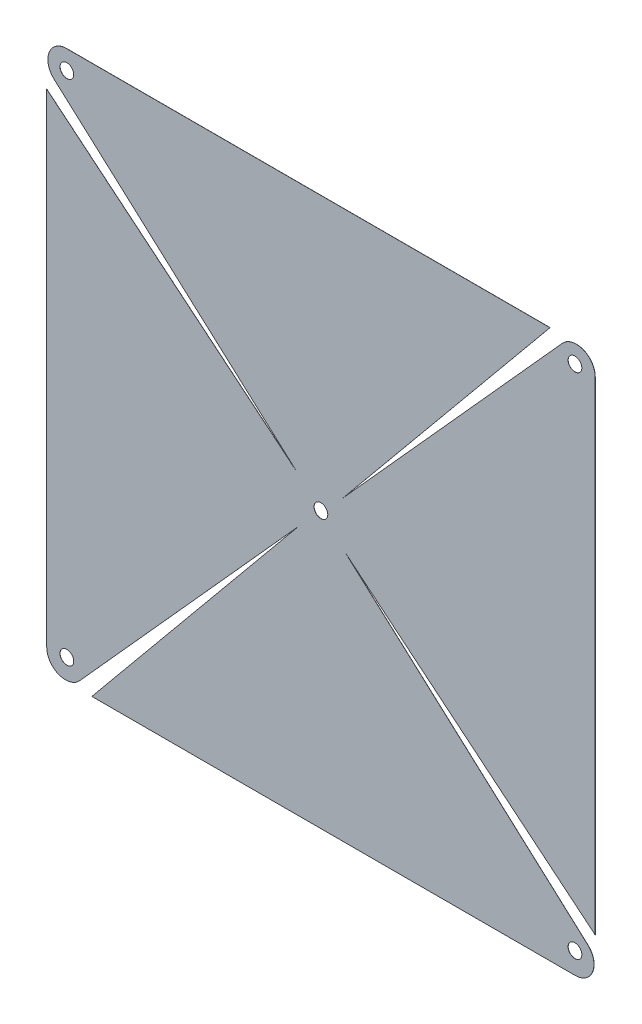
ISO-10303-21;
HEADER;
FILE_DESCRIPTION(('STEP AP214'),'2;1');
FILE_NAME('part.step','',(''),(''),'','','');
FILE_SCHEMA(('AUTOMOTIVE_DESIGN { 1 0 10303 214 1 1 1 1 }'));
ENDSEC;
DATA;
#1=APPLICATION_CONTEXT('core data for automotive mechanical design processes');
#2=APPLICATION_PROTOCOL_DEFINITION('international standard','automotive_design',2000,#1);
#3=PRODUCT_CONTEXT('',#1,'mechanical');
#4=PRODUCT('Part','Part','',(#3));
#5=PRODUCT_RELATED_PRODUCT_CATEGORY('part','',(#4));
#6=PRODUCT_DEFINITION_FORMATION('','',#4);
#7=PRODUCT_DEFINITION_CONTEXT('part definition',#1,'design');
#8=PRODUCT_DEFINITION('design','',#6,#7);
#9=PRODUCT_DEFINITION_SHAPE('','',#8);
#10=(LENGTH_UNIT() NAMED_UNIT(*) SI_UNIT(.MILLI.,.METRE.));
#11=(NAMED_UNIT(*) PLANE_ANGLE_UNIT() SI_UNIT($,.RADIAN.));
#12=(NAMED_UNIT(*) SI_UNIT($,.STERADIAN.) SOLID_ANGLE_UNIT());
#13=UNCERTAINTY_MEASURE_WITH_UNIT(LENGTH_MEASURE(1.E-05),#10,'distance_accuracy_value','');
#14=(GEOMETRIC_REPRESENTATION_CONTEXT(3) GLOBAL_UNCERTAINTY_ASSIGNED_CONTEXT((#13)) GLOBAL_UNIT_ASSIGNED_CONTEXT((#10,
#11,#12)) REPRESENTATION_CONTEXT('',''));
#15=CARTESIAN_POINT('',(0.,0.,0.));
#16=DIRECTION('',(0.,0.,1.));
#17=DIRECTION('',(1.,0.,0.));
#18=AXIS2_PLACEMENT_3D('',#15,#16,#17);
#19=CARTESIAN_POINT('',(0.,0.,0.0254));
#20=DIRECTION('',(0.,0.,1.));
#21=DIRECTION('',(1.,0.,0.));
#22=AXIS2_PLACEMENT_3D('',#19,#20,#21);
#23=PLANE('',#22);
#24=CARTESIAN_POINT('',(-51.3920991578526,-51.3920991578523,0.0254));
#25=DIRECTION('',(0.,0.,1.));
#26=DIRECTION('',(1.,0.,0.));
#27=AXIS2_PLACEMENT_3D('',#24,#25,#26);
#28=CIRCLE('',#27,1.3890625);
#29=CARTESIAN_POINT('',(-50.0030366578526,-51.3920991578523,0.0254));
#30=VERTEX_POINT('',#29);
#31=EDGE_CURVE('E432',#30,#30,#28,.T.);
#32=ORIENTED_EDGE('',*,*,#31,.F.);
#33=EDGE_LOOP('',(#32));
#34=FACE_BOUND('',#33,.T.);
#35=CARTESIAN_POINT('',(51.3920991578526,51.3920991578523,0.0254));
#36=DIRECTION('',(0.,0.,1.));
#37=DIRECTION('',(1.,0.,0.));
#38=AXIS2_PLACEMENT_3D('',#35,#36,#37);
#39=CIRCLE('',#38,1.3890625);
#40=CARTESIAN_POINT('',(52.7811616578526,51.3920991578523,0.0254));
#41=VERTEX_POINT('',#40);
#42=EDGE_CURVE('E398',#41,#41,#39,.T.);
#43=ORIENTED_EDGE('',*,*,#42,.F.);
#44=EDGE_LOOP('',(#43));
#45=FACE_BOUND('',#44,.T.);
#46=DIRECTION('',(-1.,0.,0.));
#47=VECTOR('',#46,1.);
#48=CARTESIAN_POINT('',(-61.346605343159,55.2367315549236,0.0254));
#49=LINE('',#48,#47);
#50=CARTESIAN_POINT('',(46.349121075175,55.2367315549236,0.0254));
#51=VERTEX_POINT('',#50);
#52=CARTESIAN_POINT('',(-51.4212160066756,55.2367315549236,0.0254));
#53=VERTEX_POINT('',#52);
#54=EDGE_CURVE('E287',#51,#53,#49,.T.);
#55=ORIENTED_EDGE('',*,*,#54,.T.);
#56=CARTESIAN_POINT('',(-51.4212160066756,51.4267315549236,0.0254));
#57=DIRECTION('',(0.,0.,1.));
#58=DIRECTION('',(1.,0.,0.));
#59=AXIS2_PLACEMENT_3D('',#56,#57,#58);
#60=CIRCLE('',#59,3.81);
#61=CARTESIAN_POINT('',(-53.9706036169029,48.5953497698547,0.0254));
#62=VERTEX_POINT('',#61);
#63=EDGE_CURVE('E196',#53,#62,#60,.T.);
#64=ORIENTED_EDGE('',*,*,#63,.T.);
#65=DIRECTION('',(0.743144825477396,-0.669130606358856,0.));
#66=VECTOR('',#65,1.);
#67=CARTESIAN_POINT('',(-4.71896964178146,4.24897935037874,0.0254));
#68=LINE('',#67,#66);
#69=CARTESIAN_POINT('',(-4.71896964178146,4.24897935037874,0.0254));
#70=VERTEX_POINT('',#69);
#71=EDGE_CURVE('E162',#62,#70,#68,.T.);
#72=ORIENTED_EDGE('',*,*,#71,.T.);
#73=DIRECTION('',(-0.771425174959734,0.636320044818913,0.));
#74=VECTOR('',#73,1.);
#75=CARTESIAN_POINT('',(-4.71896964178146,4.24897935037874,0.0254));
#76=LINE('',#75,#74);
#77=CARTESIAN_POINT('',(-55.4655731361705,46.1079723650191,0.0254));
#78=VERTEX_POINT('',#77);
#79=EDGE_CURVE('E156',#70,#78,#76,.T.);
#80=ORIENTED_EDGE('',*,*,#79,.T.);
#81=DIRECTION('',(0.,-1.,0.));
#82=VECTOR('',#81,1.);
#83=CARTESIAN_POINT('',(-55.4655731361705,-61.5877540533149,0.0254));
#84=LINE('',#83,#82);
#85=CARTESIAN_POINT('',(-55.4655731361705,-51.6623647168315,0.0254));
#86=VERTEX_POINT('',#85);
#87=EDGE_CURVE('E145',#78,#86,#84,.T.);
#88=ORIENTED_EDGE('',*,*,#87,.T.);
#89=CARTESIAN_POINT('',(-51.6555731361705,-51.6623647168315,0.0254));
#90=DIRECTION('',(0.,0.,1.));
#91=DIRECTION('',(1.,0.,0.));
#92=AXIS2_PLACEMENT_3D('',#89,#90,#91);
#93=CIRCLE('',#92,3.81);
#94=CARTESIAN_POINT('',(-48.8241913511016,-54.2117523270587,0.0254));
#95=VERTEX_POINT('',#94);
#96=EDGE_CURVE('E194',#86,#95,#93,.T.);
#97=ORIENTED_EDGE('',*,*,#96,.T.);
#98=DIRECTION('',(0.669130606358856,0.743144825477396,0.));
#99=VECTOR('',#98,1.);
#100=CARTESIAN_POINT('',(-4.47782093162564,-4.96011835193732,0.0254));
#101=LINE('',#100,#99);
#102=CARTESIAN_POINT('',(-4.47782093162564,-4.96011835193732,0.0254));
#103=VERTEX_POINT('',#102);
#104=EDGE_CURVE('E155',#95,#103,#101,.T.);
#105=ORIENTED_EDGE('',*,*,#104,.T.);
#106=DIRECTION('',(-0.636320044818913,-0.771425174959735,0.));
#107=VECTOR('',#106,1.);
#108=CARTESIAN_POINT('',(-4.47782093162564,-4.96011835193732,0.0254));
#109=LINE('',#108,#107);
#110=CARTESIAN_POINT('',(-46.336813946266,-55.7067218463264,0.0254));
#111=VERTEX_POINT('',#110);
#112=EDGE_CURVE('E299',#103,#111,#109,.T.);
#113=ORIENTED_EDGE('',*,*,#112,.T.);
#114=DIRECTION('',(1.,0.,0.));
#115=VECTOR('',#114,1.);
#116=CARTESIAN_POINT('',(61.358912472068,-55.7067218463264,0.0254));
#117=LINE('',#116,#115);
#118=CARTESIAN_POINT('',(51.4335231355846,-55.7067218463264,0.0254));
#119=VERTEX_POINT('',#118);
#120=EDGE_CURVE('E257',#111,#119,#117,.T.);
#121=ORIENTED_EDGE('',*,*,#120,.T.);
#122=CARTESIAN_POINT('',(51.4335231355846,-51.8967218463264,0.0254));
#123=DIRECTION('',(0.,0.,1.));
#124=DIRECTION('',(1.,0.,0.));
#125=AXIS2_PLACEMENT_3D('',#122,#123,#124);
#126=CIRCLE('',#125,3.81);
#127=CARTESIAN_POINT('',(53.9829107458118,-49.0653400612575,0.0254));
#128=VERTEX_POINT('',#127);
#129=EDGE_CURVE('E192',#119,#128,#126,.T.);
#130=ORIENTED_EDGE('',*,*,#129,.T.);
#131=DIRECTION('',(-0.743144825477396,0.669130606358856,0.));
#132=VECTOR('',#131,1.);
#133=CARTESIAN_POINT('',(4.73127677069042,-4.7189696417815,0.0254));
#134=LINE('',#133,#132);
#135=CARTESIAN_POINT('',(4.73127677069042,-4.7189696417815,0.0254));
#136=VERTEX_POINT('',#135);
#137=EDGE_CURVE('E282',#128,#136,#134,.T.);
#138=ORIENTED_EDGE('',*,*,#137,.T.);
#139=DIRECTION('',(0.771425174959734,-0.636320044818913,0.));
#140=VECTOR('',#139,1.);
#141=CARTESIAN_POINT('',(4.73127677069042,-4.7189696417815,0.0254));
#142=LINE('',#141,#140);
#143=CARTESIAN_POINT('',(55.4778802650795,-46.5779626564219,0.0254));
#144=VERTEX_POINT('',#143);
#145=EDGE_CURVE('E278',#136,#144,#142,.T.);
#146=ORIENTED_EDGE('',*,*,#145,.T.);
#147=DIRECTION('',(0.,1.,0.));
#148=VECTOR('',#147,1.);
#149=CARTESIAN_POINT('',(55.4778802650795,61.1177637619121,0.0254));
#150=LINE('',#149,#148);
#151=CARTESIAN_POINT('',(55.4778802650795,51.1923744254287,0.0254));
#152=VERTEX_POINT('',#151);
#153=EDGE_CURVE('E277',#144,#152,#150,.T.);
#154=ORIENTED_EDGE('',*,*,#153,.T.);
#155=CARTESIAN_POINT('',(51.6678802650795,51.1923744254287,0.0254));
#156=DIRECTION('',(0.,0.,1.));
#157=DIRECTION('',(1.,0.,0.));
#158=AXIS2_PLACEMENT_3D('',#155,#156,#157);
#159=CIRCLE('',#158,3.81);
#160=CARTESIAN_POINT('',(48.8364984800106,53.741762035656,0.0254));
#161=VERTEX_POINT('',#160);
#162=EDGE_CURVE('E47',#152,#161,#159,.T.);
#163=ORIENTED_EDGE('',*,*,#162,.T.);
#164=DIRECTION('',(-0.669130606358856,-0.743144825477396,0.));
#165=VECTOR('',#164,1.);
#166=CARTESIAN_POINT('',(4.49012806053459,4.49012806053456,0.0254));
#167=LINE('',#166,#165);
#168=CARTESIAN_POINT('',(4.49012806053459,4.49012806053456,0.0254));
#169=VERTEX_POINT('',#168);
#170=EDGE_CURVE('E214',#161,#169,#167,.T.);
#171=ORIENTED_EDGE('',*,*,#170,.T.);
#172=DIRECTION('',(0.636320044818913,0.771425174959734,0.));
#173=VECTOR('',#172,1.);
#174=CARTESIAN_POINT('',(4.49012806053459,4.49012806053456,0.0254));
#175=LINE('',#174,#173);
#176=EDGE_CURVE('E280',#169,#51,#175,.T.);
#177=ORIENTED_EDGE('',*,*,#176,.T.);
#178=EDGE_LOOP('',(#55,#64,#72,#80,#88,#97,#105,#113,#121,#130,#138,#146,#154,#163,#171,#177));
#179=FACE_BOUND('',#178,.T.);
#180=CARTESIAN_POINT('',(0.,0.,0.0254));
#181=DIRECTION('',(0.,0.,1.));
#182=DIRECTION('',(1.,0.,0.));
#183=AXIS2_PLACEMENT_3D('',#180,#181,#182);
#184=CIRCLE('',#183,1.3890625);
#185=CARTESIAN_POINT('',(1.3890625,0.,0.0254));
#186=VERTEX_POINT('',#185);
#187=EDGE_CURVE('E292',#186,#186,#184,.T.);
#188=ORIENTED_EDGE('',*,*,#187,.F.);
#189=EDGE_LOOP('',(#188));
#190=FACE_BOUND('',#189,.T.);
#191=CARTESIAN_POINT('',(51.3920991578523,-51.3920991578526,0.0254));
#192=DIRECTION('',(0.,0.,1.));
#193=DIRECTION('',(1.,0.,0.));
#194=AXIS2_PLACEMENT_3D('',#191,#192,#193);
#195=CIRCLE('',#194,1.38906249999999);
#196=CARTESIAN_POINT('',(52.7811616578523,-51.3920991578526,0.0254));
#197=VERTEX_POINT('',#196);
#198=EDGE_CURVE('E403',#197,#197,#195,.T.);
#199=ORIENTED_EDGE('',*,*,#198,.F.);
#200=EDGE_LOOP('',(#199));
#201=FACE_BOUND('',#200,.T.);
#202=CARTESIAN_POINT('',(-51.3920991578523,51.3920991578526,0.0254));
#203=DIRECTION('',(0.,0.,1.));
#204=DIRECTION('',(1.,0.,0.));
#205=AXIS2_PLACEMENT_3D('',#202,#203,#204);
#206=CIRCLE('',#205,1.38906249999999);
#207=CARTESIAN_POINT('',(-50.0030366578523,51.3920991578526,0.0254));
#208=VERTEX_POINT('',#207);
#209=EDGE_CURVE('E428',#208,#208,#206,.T.);
#210=ORIENTED_EDGE('',*,*,#209,.F.);
#211=EDGE_LOOP('',(#210));
#212=FACE_BOUND('',#211,.T.);
#213=ADVANCED_FACE('F32',(#34,#45,#179,#190,#201,#212),#23,.T.);
#214=CARTESIAN_POINT('',(0.,0.,0.));
#215=DIRECTION('',(0.,0.,1.));
#216=DIRECTION('',(1.,0.,0.));
#217=AXIS2_PLACEMENT_3D('',#214,#215,#216);
#218=PLANE('',#217);
#219=DIRECTION('',(0.743144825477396,-0.669130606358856,0.));
#220=VECTOR('',#219,1.);
#221=CARTESIAN_POINT('',(-4.71896964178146,4.24897935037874,0.));
#222=LINE('',#221,#220);
#223=CARTESIAN_POINT('',(-53.9706036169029,48.5953497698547,0.));
#224=VERTEX_POINT('',#223);
#225=CARTESIAN_POINT('',(-4.71896964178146,4.24897935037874,0.));
#226=VERTEX_POINT('',#225);
#227=EDGE_CURVE('E166',#224,#226,#222,.T.);
#228=ORIENTED_EDGE('',*,*,#227,.F.);
#229=CARTESIAN_POINT('',(-51.4212160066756,51.4267315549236,0.));
#230=DIRECTION('',(0.,0.,1.));
#231=DIRECTION('',(1.,0.,0.));
#232=AXIS2_PLACEMENT_3D('',#229,#230,#231);
#233=CIRCLE('',#232,3.81);
#234=CARTESIAN_POINT('',(-51.4212160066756,55.2367315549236,0.));
#235=VERTEX_POINT('',#234);
#236=EDGE_CURVE('E187',#224,#235,#233,.F.);
#237=ORIENTED_EDGE('',*,*,#236,.T.);
#238=DIRECTION('',(-1.,0.,0.));
#239=VECTOR('',#238,1.);
#240=CARTESIAN_POINT('',(-61.346605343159,55.2367315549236,0.));
#241=LINE('',#240,#239);
#242=CARTESIAN_POINT('',(46.349121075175,55.2367315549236,0.));
#243=VERTEX_POINT('',#242);
#244=EDGE_CURVE('E226',#243,#235,#241,.T.);
#245=ORIENTED_EDGE('',*,*,#244,.F.);
#246=DIRECTION('',(0.636320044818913,0.771425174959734,0.));
#247=VECTOR('',#246,1.);
#248=CARTESIAN_POINT('',(4.49012806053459,4.49012806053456,0.));
#249=LINE('',#248,#247);
#250=CARTESIAN_POINT('',(4.49012806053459,4.49012806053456,0.));
#251=VERTEX_POINT('',#250);
#252=EDGE_CURVE('E223',#251,#243,#249,.T.);
#253=ORIENTED_EDGE('',*,*,#252,.F.);
#254=DIRECTION('',(-0.669130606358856,-0.743144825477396,0.));
#255=VECTOR('',#254,1.);
#256=CARTESIAN_POINT('',(4.49012806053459,4.49012806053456,0.));
#257=LINE('',#256,#255);
#258=CARTESIAN_POINT('',(48.8364984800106,53.741762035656,0.));
#259=VERTEX_POINT('',#258);
#260=EDGE_CURVE('E212',#259,#251,#257,.T.);
#261=ORIENTED_EDGE('',*,*,#260,.F.);
#262=CARTESIAN_POINT('',(51.6678802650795,51.1923744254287,0.));
#263=DIRECTION('',(0.,0.,1.));
#264=DIRECTION('',(1.,0.,0.));
#265=AXIS2_PLACEMENT_3D('',#262,#263,#264);
#266=CIRCLE('',#265,3.81);
#267=CARTESIAN_POINT('',(55.4778802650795,51.1923744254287,0.));
#268=VERTEX_POINT('',#267);
#269=EDGE_CURVE('E175',#259,#268,#266,.F.);
#270=ORIENTED_EDGE('',*,*,#269,.T.);
#271=DIRECTION('',(0.,1.,0.));
#272=VECTOR('',#271,1.);
#273=CARTESIAN_POINT('',(55.4778802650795,61.1177637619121,0.));
#274=LINE('',#273,#272);
#275=CARTESIAN_POINT('',(55.4778802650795,-46.5779626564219,0.));
#276=VERTEX_POINT('',#275);
#277=EDGE_CURVE('E224',#276,#268,#274,.T.);
#278=ORIENTED_EDGE('',*,*,#277,.F.);
#279=DIRECTION('',(0.771425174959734,-0.636320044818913,0.));
#280=VECTOR('',#279,1.);
#281=CARTESIAN_POINT('',(4.73127677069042,-4.7189696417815,0.));
#282=LINE('',#281,#280);
#283=CARTESIAN_POINT('',(4.73127677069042,-4.7189696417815,0.));
#284=VERTEX_POINT('',#283);
#285=EDGE_CURVE('E228',#284,#276,#282,.T.);
#286=ORIENTED_EDGE('',*,*,#285,.F.);
#287=DIRECTION('',(-0.743144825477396,0.669130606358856,0.));
#288=VECTOR('',#287,1.);
#289=CARTESIAN_POINT('',(4.73127677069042,-4.7189696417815,0.));
#290=LINE('',#289,#288);
#291=CARTESIAN_POINT('',(53.9829107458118,-49.0653400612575,0.));
#292=VERTEX_POINT('',#291);
#293=EDGE_CURVE('E264',#292,#284,#290,.T.);
#294=ORIENTED_EDGE('',*,*,#293,.F.);
#295=CARTESIAN_POINT('',(51.4335231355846,-51.8967218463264,0.));
#296=DIRECTION('',(0.,0.,1.));
#297=DIRECTION('',(1.,0.,0.));
#298=AXIS2_PLACEMENT_3D('',#295,#296,#297);
#299=CIRCLE('',#298,3.81);
#300=CARTESIAN_POINT('',(51.4335231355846,-55.7067218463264,0.));
#301=VERTEX_POINT('',#300);
#302=EDGE_CURVE('E183',#292,#301,#299,.F.);
#303=ORIENTED_EDGE('',*,*,#302,.T.);
#304=DIRECTION('',(1.,0.,0.));
#305=VECTOR('',#304,1.);
#306=CARTESIAN_POINT('',(61.358912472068,-55.7067218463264,0.));
#307=LINE('',#306,#305);
#308=CARTESIAN_POINT('',(-46.336813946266,-55.7067218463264,0.));
#309=VERTEX_POINT('',#308);
#310=EDGE_CURVE('E254',#309,#301,#307,.T.);
#311=ORIENTED_EDGE('',*,*,#310,.F.);
#312=DIRECTION('',(-0.636320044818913,-0.771425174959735,0.));
#313=VECTOR('',#312,1.);
#314=CARTESIAN_POINT('',(-4.47782093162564,-4.96011835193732,0.));
#315=LINE('',#314,#313);
#316=CARTESIAN_POINT('',(-4.47782093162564,-4.96011835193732,0.));
#317=VERTEX_POINT('',#316);
#318=EDGE_CURVE('E262',#317,#309,#315,.T.);
#319=ORIENTED_EDGE('',*,*,#318,.F.);
#320=DIRECTION('',(0.669130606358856,0.743144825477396,0.));
#321=VECTOR('',#320,1.);
#322=CARTESIAN_POINT('',(-4.47782093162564,-4.96011835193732,0.));
#323=LINE('',#322,#321);
#324=CARTESIAN_POINT('',(-48.8241913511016,-54.2117523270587,0.));
#325=VERTEX_POINT('',#324);
#326=EDGE_CURVE('E267',#325,#317,#323,.T.);
#327=ORIENTED_EDGE('',*,*,#326,.F.);
#328=CARTESIAN_POINT('',(-51.6555731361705,-51.6623647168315,0.));
#329=DIRECTION('',(0.,0.,1.));
#330=DIRECTION('',(1.,0.,0.));
#331=AXIS2_PLACEMENT_3D('',#328,#329,#330);
#332=CIRCLE('',#331,3.81);
#333=CARTESIAN_POINT('',(-55.4655731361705,-51.6623647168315,0.));
#334=VERTEX_POINT('',#333);
#335=EDGE_CURVE('E185',#325,#334,#332,.F.);
#336=ORIENTED_EDGE('',*,*,#335,.T.);
#337=DIRECTION('',(0.,-1.,0.));
#338=VECTOR('',#337,1.);
#339=CARTESIAN_POINT('',(-55.4655731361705,-61.5877540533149,0.));
#340=LINE('',#339,#338);
#341=CARTESIAN_POINT('',(-55.4655731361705,46.1079723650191,0.));
#342=VERTEX_POINT('',#341);
#343=EDGE_CURVE('E291',#342,#334,#340,.T.);
#344=ORIENTED_EDGE('',*,*,#343,.F.);
#345=DIRECTION('',(-0.771425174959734,0.636320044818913,0.));
#346=VECTOR('',#345,1.);
#347=CARTESIAN_POINT('',(-4.71896964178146,4.24897935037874,0.));
#348=LINE('',#347,#346);
#349=EDGE_CURVE('E170',#226,#342,#348,.T.);
#350=ORIENTED_EDGE('',*,*,#349,.F.);
#351=EDGE_LOOP('',(#228,#237,#245,#253,#261,#270,#278,#286,#294,#303,#311,#319,#327,#336,#344,#350));
#352=FACE_BOUND('',#351,.T.);
#353=CARTESIAN_POINT('',(0.,0.,0.));
#354=DIRECTION('',(0.,0.,1.));
#355=DIRECTION('',(1.,0.,0.));
#356=AXIS2_PLACEMENT_3D('',#353,#354,#355);
#357=CIRCLE('',#356,1.3890625);
#358=CARTESIAN_POINT('',(1.3890625,0.,0.));
#359=VERTEX_POINT('',#358);
#360=EDGE_CURVE('E405',#359,#359,#357,.T.);
#361=ORIENTED_EDGE('',*,*,#360,.T.);
#362=EDGE_LOOP('',(#361));
#363=FACE_BOUND('',#362,.T.);
#364=CARTESIAN_POINT('',(51.3920991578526,51.3920991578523,0.));
#365=DIRECTION('',(0.,0.,1.));
#366=DIRECTION('',(1.,0.,0.));
#367=AXIS2_PLACEMENT_3D('',#364,#365,#366);
#368=CIRCLE('',#367,1.3890625);
#369=CARTESIAN_POINT('',(52.7811616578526,51.3920991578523,0.));
#370=VERTEX_POINT('',#369);
#371=EDGE_CURVE('E401',#370,#370,#368,.T.);
#372=ORIENTED_EDGE('',*,*,#371,.T.);
#373=EDGE_LOOP('',(#372));
#374=FACE_BOUND('',#373,.T.);
#375=CARTESIAN_POINT('',(51.3920991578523,-51.3920991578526,0.));
#376=DIRECTION('',(0.,0.,1.));
#377=DIRECTION('',(1.,0.,0.));
#378=AXIS2_PLACEMENT_3D('',#375,#376,#377);
#379=CIRCLE('',#378,1.38906249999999);
#380=CARTESIAN_POINT('',(52.7811616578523,-51.3920991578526,0.));
#381=VERTEX_POINT('',#380);
#382=EDGE_CURVE('E408',#381,#381,#379,.T.);
#383=ORIENTED_EDGE('',*,*,#382,.T.);
#384=EDGE_LOOP('',(#383));
#385=FACE_BOUND('',#384,.T.);
#386=CARTESIAN_POINT('',(-51.3920991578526,-51.3920991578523,0.));
#387=DIRECTION('',(0.,0.,1.));
#388=DIRECTION('',(1.,0.,0.));
#389=AXIS2_PLACEMENT_3D('',#386,#387,#388);
#390=CIRCLE('',#389,1.3890625);
#391=CARTESIAN_POINT('',(-50.0030366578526,-51.3920991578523,0.));
#392=VERTEX_POINT('',#391);
#393=EDGE_CURVE('E424',#392,#392,#390,.T.);
#394=ORIENTED_EDGE('',*,*,#393,.T.);
#395=EDGE_LOOP('',(#394));
#396=FACE_BOUND('',#395,.T.);
#397=CARTESIAN_POINT('',(-51.3920991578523,51.3920991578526,0.));
#398=DIRECTION('',(0.,0.,1.));
#399=DIRECTION('',(1.,0.,0.));
#400=AXIS2_PLACEMENT_3D('',#397,#398,#399);
#401=CIRCLE('',#400,1.38906249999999);
#402=CARTESIAN_POINT('',(-50.0030366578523,51.3920991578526,0.));
#403=VERTEX_POINT('',#402);
#404=EDGE_CURVE('E427',#403,#403,#401,.T.);
#405=ORIENTED_EDGE('',*,*,#404,.T.);
#406=EDGE_LOOP('',(#405));
#407=FACE_BOUND('',#406,.T.);
#408=ADVANCED_FACE('F219',(#352,#363,#374,#385,#396,#407),#218,.F.);
#409=CARTESIAN_POINT('',(-4.71896964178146,4.24897935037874,0.0254));
#410=DIRECTION('',(-0.636320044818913,-0.771425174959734,0.));
#411=DIRECTION('',(0.771425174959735,-0.636320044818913,0.));
#412=AXIS2_PLACEMENT_3D('',#409,#410,#411);
#413=PLANE('',#412);
#414=ORIENTED_EDGE('',*,*,#349,.T.);
#415=DIRECTION('',(0.,0.,-1.));
#416=VECTOR('',#415,1.);
#417=CARTESIAN_POINT('',(-55.4655731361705,46.1079723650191,0.0254));
#418=LINE('',#417,#416);
#419=EDGE_CURVE('E150',#78,#342,#418,.T.);
#420=ORIENTED_EDGE('',*,*,#419,.F.);
#421=ORIENTED_EDGE('',*,*,#79,.F.);
#422=DIRECTION('',(0.,0.,-1.));
#423=VECTOR('',#422,1.);
#424=CARTESIAN_POINT('',(-4.71896964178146,4.24897935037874,0.0254));
#425=LINE('',#424,#423);
#426=EDGE_CURVE('E235',#70,#226,#425,.T.);
#427=ORIENTED_EDGE('',*,*,#426,.T.);
#428=EDGE_LOOP('',(#414,#420,#421,#427));
#429=FACE_BOUND('',#428,.T.);
#430=ADVANCED_FACE('F168',(#429),#413,.F.);
#431=CARTESIAN_POINT('',(-55.4655731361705,-61.5877540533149,0.0254));
#432=DIRECTION('',(1.,0.,0.));
#433=DIRECTION('',(0.,1.,0.));
#434=AXIS2_PLACEMENT_3D('',#431,#432,#433);
#435=PLANE('',#434);
#436=ORIENTED_EDGE('',*,*,#343,.T.);
#437=DIRECTION('',(0.,0.,-1.));
#438=VECTOR('',#437,1.);
#439=CARTESIAN_POINT('',(-55.4655731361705,-51.6623647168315,0.0254));
#440=LINE('',#439,#438);
#441=EDGE_CURVE('E153',#334,#86,#440,.F.);
#442=ORIENTED_EDGE('',*,*,#441,.T.);
#443=ORIENTED_EDGE('',*,*,#87,.F.);
#444=ORIENTED_EDGE('',*,*,#419,.T.);
#445=EDGE_LOOP('',(#436,#442,#443,#444));
#446=FACE_BOUND('',#445,.T.);
#447=ADVANCED_FACE('F148',(#446),#435,.F.);
#448=CARTESIAN_POINT('',(-4.47782093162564,-4.96011835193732,0.0254));
#449=DIRECTION('',(-0.743144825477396,0.669130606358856,0.));
#450=DIRECTION('',(-0.669130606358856,-0.743144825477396,0.));
#451=AXIS2_PLACEMENT_3D('',#448,#449,#450);
#452=PLANE('',#451);
#453=ORIENTED_EDGE('',*,*,#104,.F.);
#454=DIRECTION('',(0.,0.,-1.));
#455=VECTOR('',#454,1.);
#456=CARTESIAN_POINT('',(-48.8241913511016,-54.2117523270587,0.0254));
#457=LINE('',#456,#455);
#458=EDGE_CURVE('E198',#95,#325,#457,.T.);
#459=ORIENTED_EDGE('',*,*,#458,.T.);
#460=ORIENTED_EDGE('',*,*,#326,.T.);
#461=DIRECTION('',(0.,0.,-1.));
#462=VECTOR('',#461,1.);
#463=CARTESIAN_POINT('',(-4.47782093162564,-4.96011835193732,0.0254));
#464=LINE('',#463,#462);
#465=EDGE_CURVE('E172',#103,#317,#464,.T.);
#466=ORIENTED_EDGE('',*,*,#465,.F.);
#467=EDGE_LOOP('',(#453,#459,#460,#466));
#468=FACE_BOUND('',#467,.T.);
#469=ADVANCED_FACE('F296',(#468),#452,.F.);
#470=CARTESIAN_POINT('',(-4.47782093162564,-4.96011835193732,0.0254));
#471=DIRECTION('',(0.771425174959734,-0.636320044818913,0.));
#472=DIRECTION('',(0.636320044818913,0.771425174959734,0.));
#473=AXIS2_PLACEMENT_3D('',#470,#471,#472);
#474=PLANE('',#473);
#475=ORIENTED_EDGE('',*,*,#318,.T.);
#476=DIRECTION('',(0.,0.,-1.));
#477=VECTOR('',#476,1.);
#478=CARTESIAN_POINT('',(-46.336813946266,-55.7067218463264,0.0254));
#479=LINE('',#478,#477);
#480=EDGE_CURVE('E178',#111,#309,#479,.T.);
#481=ORIENTED_EDGE('',*,*,#480,.F.);
#482=ORIENTED_EDGE('',*,*,#112,.F.);
#483=ORIENTED_EDGE('',*,*,#465,.T.);
#484=EDGE_LOOP('',(#475,#481,#482,#483));
#485=FACE_BOUND('',#484,.T.);
#486=ADVANCED_FACE('F298',(#485),#474,.F.);
#487=CARTESIAN_POINT('',(61.358912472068,-55.7067218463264,0.0254));
#488=DIRECTION('',(0.,1.,0.));
#489=DIRECTION('',(-1.,0.,0.));
#490=AXIS2_PLACEMENT_3D('',#487,#488,#489);
#491=PLANE('',#490);
#492=ORIENTED_EDGE('',*,*,#310,.T.);
#493=DIRECTION('',(0.,0.,-1.));
#494=VECTOR('',#493,1.);
#495=CARTESIAN_POINT('',(51.4335231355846,-55.7067218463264,0.0254));
#496=LINE('',#495,#494);
#497=EDGE_CURVE('E205',#301,#119,#496,.F.);
#498=ORIENTED_EDGE('',*,*,#497,.T.);
#499=ORIENTED_EDGE('',*,*,#120,.F.);
#500=ORIENTED_EDGE('',*,*,#480,.T.);
#501=EDGE_LOOP('',(#492,#498,#499,#500));
#502=FACE_BOUND('',#501,.T.);
#503=ADVANCED_FACE('F253',(#502),#491,.F.);
#504=CARTESIAN_POINT('',(4.73127677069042,-4.7189696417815,0.0254));
#505=DIRECTION('',(-0.669130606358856,-0.743144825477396,0.));
#506=DIRECTION('',(0.743144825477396,-0.669130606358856,0.));
#507=AXIS2_PLACEMENT_3D('',#504,#505,#506);
#508=PLANE('',#507);
#509=ORIENTED_EDGE('',*,*,#137,.F.);
#510=DIRECTION('',(0.,0.,-1.));
#511=VECTOR('',#510,1.);
#512=CARTESIAN_POINT('',(53.9829107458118,-49.0653400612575,0.0254));
#513=LINE('',#512,#511);
#514=EDGE_CURVE('E202',#128,#292,#513,.T.);
#515=ORIENTED_EDGE('',*,*,#514,.T.);
#516=ORIENTED_EDGE('',*,*,#293,.T.);
#517=DIRECTION('',(0.,0.,-1.));
#518=VECTOR('',#517,1.);
#519=CARTESIAN_POINT('',(4.73127677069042,-4.7189696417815,0.0254));
#520=LINE('',#519,#518);
#521=EDGE_CURVE('E245',#136,#284,#520,.T.);
#522=ORIENTED_EDGE('',*,*,#521,.F.);
#523=EDGE_LOOP('',(#509,#515,#516,#522));
#524=FACE_BOUND('',#523,.T.);
#525=ADVANCED_FACE('F307',(#524),#508,.F.);
#526=CARTESIAN_POINT('',(4.73127677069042,-4.7189696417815,0.0254));
#527=DIRECTION('',(0.636320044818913,0.771425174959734,0.));
#528=DIRECTION('',(-0.771425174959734,0.636320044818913,0.));
#529=AXIS2_PLACEMENT_3D('',#526,#527,#528);
#530=PLANE('',#529);
#531=ORIENTED_EDGE('',*,*,#285,.T.);
#532=DIRECTION('',(0.,0.,-1.));
#533=VECTOR('',#532,1.);
#534=CARTESIAN_POINT('',(55.4778802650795,-46.5779626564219,0.0254));
#535=LINE('',#534,#533);
#536=EDGE_CURVE('E242',#144,#276,#535,.T.);
#537=ORIENTED_EDGE('',*,*,#536,.F.);
#538=ORIENTED_EDGE('',*,*,#145,.F.);
#539=ORIENTED_EDGE('',*,*,#521,.T.);
#540=EDGE_LOOP('',(#531,#537,#538,#539));
#541=FACE_BOUND('',#540,.T.);
#542=ADVANCED_FACE('F273',(#541),#530,.F.);
#543=CARTESIAN_POINT('',(55.4778802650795,61.1177637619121,0.0254));
#544=DIRECTION('',(-1.,0.,0.));
#545=DIRECTION('',(0.,0.,1.));
#546=AXIS2_PLACEMENT_3D('',#543,#544,#545);
#547=PLANE('',#546);
#548=ORIENTED_EDGE('',*,*,#277,.T.);
#549=DIRECTION('',(0.,0.,-1.));
#550=VECTOR('',#549,1.);
#551=CARTESIAN_POINT('',(55.4778802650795,51.1923744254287,0.0254));
#552=LINE('',#551,#550);
#553=EDGE_CURVE('E11',#268,#152,#552,.F.);
#554=ORIENTED_EDGE('',*,*,#553,.T.);
#555=ORIENTED_EDGE('',*,*,#153,.F.);
#556=ORIENTED_EDGE('',*,*,#536,.T.);
#557=EDGE_LOOP('',(#548,#554,#555,#556));
#558=FACE_BOUND('',#557,.T.);
#559=ADVANCED_FACE('F276',(#558),#547,.F.);
#560=CARTESIAN_POINT('',(4.49012806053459,4.49012806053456,0.0254));
#561=DIRECTION('',(0.743144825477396,-0.669130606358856,0.));
#562=DIRECTION('',(0.669130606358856,0.743144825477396,0.));
#563=AXIS2_PLACEMENT_3D('',#560,#561,#562);
#564=PLANE('',#563);
#565=ORIENTED_EDGE('',*,*,#170,.F.);
#566=DIRECTION('',(0.,0.,-1.));
#567=VECTOR('',#566,1.);
#568=CARTESIAN_POINT('',(48.8364984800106,53.741762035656,0.0254));
#569=LINE('',#568,#567);
#570=EDGE_CURVE('E40',#161,#259,#569,.T.);
#571=ORIENTED_EDGE('',*,*,#570,.T.);
#572=ORIENTED_EDGE('',*,*,#260,.T.);
#573=DIRECTION('',(0.,0.,-1.));
#574=VECTOR('',#573,1.);
#575=CARTESIAN_POINT('',(4.49012806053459,4.49012806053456,0.0254));
#576=LINE('',#575,#574);
#577=EDGE_CURVE('E240',#169,#251,#576,.T.);
#578=ORIENTED_EDGE('',*,*,#577,.F.);
#579=EDGE_LOOP('',(#565,#571,#572,#578));
#580=FACE_BOUND('',#579,.T.);
#581=ADVANCED_FACE('F210',(#580),#564,.F.);
#582=CARTESIAN_POINT('',(4.49012806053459,4.49012806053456,0.0254));
#583=DIRECTION('',(-0.771425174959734,0.636320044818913,0.));
#584=DIRECTION('',(-0.636320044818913,-0.771425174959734,0.));
#585=AXIS2_PLACEMENT_3D('',#582,#583,#584);
#586=PLANE('',#585);
#587=ORIENTED_EDGE('',*,*,#252,.T.);
#588=DIRECTION('',(0.,0.,-1.));
#589=VECTOR('',#588,1.);
#590=CARTESIAN_POINT('',(46.349121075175,55.2367315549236,0.0254));
#591=LINE('',#590,#589);
#592=EDGE_CURVE('E237',#51,#243,#591,.T.);
#593=ORIENTED_EDGE('',*,*,#592,.F.);
#594=ORIENTED_EDGE('',*,*,#176,.F.);
#595=ORIENTED_EDGE('',*,*,#577,.T.);
#596=EDGE_LOOP('',(#587,#593,#594,#595));
#597=FACE_BOUND('',#596,.T.);
#598=ADVANCED_FACE('F339',(#597),#586,.F.);
#599=CARTESIAN_POINT('',(-61.346605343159,55.2367315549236,0.0254));
#600=DIRECTION('',(0.,-1.,0.));
#601=DIRECTION('',(0.,0.,-1.));
#602=AXIS2_PLACEMENT_3D('',#599,#600,#601);
#603=PLANE('',#602);
#604=ORIENTED_EDGE('',*,*,#244,.T.);
#605=DIRECTION('',(0.,0.,-1.));
#606=VECTOR('',#605,1.);
#607=CARTESIAN_POINT('',(-51.4212160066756,55.2367315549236,0.0254));
#608=LINE('',#607,#606);
#609=EDGE_CURVE('E189',#235,#53,#608,.F.);
#610=ORIENTED_EDGE('',*,*,#609,.T.);
#611=ORIENTED_EDGE('',*,*,#54,.F.);
#612=ORIENTED_EDGE('',*,*,#592,.T.);
#613=EDGE_LOOP('',(#604,#610,#611,#612));
#614=FACE_BOUND('',#613,.T.);
#615=ADVANCED_FACE('F335',(#614),#603,.F.);
#616=CARTESIAN_POINT('',(-4.71896964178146,4.24897935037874,0.0254));
#617=DIRECTION('',(0.669130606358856,0.743144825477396,0.));
#618=DIRECTION('',(-0.743144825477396,0.669130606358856,0.));
#619=AXIS2_PLACEMENT_3D('',#616,#617,#618);
#620=PLANE('',#619);
#621=ORIENTED_EDGE('',*,*,#71,.F.);
#622=DIRECTION('',(0.,0.,-1.));
#623=VECTOR('',#622,1.);
#624=CARTESIAN_POINT('',(-53.9706036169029,48.5953497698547,0.0254));
#625=LINE('',#624,#623);
#626=EDGE_CURVE('E171',#62,#224,#625,.T.);
#627=ORIENTED_EDGE('',*,*,#626,.T.);
#628=ORIENTED_EDGE('',*,*,#227,.T.);
#629=ORIENTED_EDGE('',*,*,#426,.F.);
#630=EDGE_LOOP('',(#621,#627,#628,#629));
#631=FACE_BOUND('',#630,.T.);
#632=ADVANCED_FACE('F332',(#631),#620,.F.);
#633=CARTESIAN_POINT('',(0.,0.,0.0254));
#634=DIRECTION('',(0.,0.,-1.));
#635=DIRECTION('',(-1.,0.,0.));
#636=AXIS2_PLACEMENT_3D('',#633,#634,#635);
#637=CYLINDRICAL_SURFACE('',#636,1.3890625);
#638=ORIENTED_EDGE('',*,*,#187,.T.);
#639=EDGE_LOOP('',(#638));
#640=FACE_BOUND('',#639,.T.);
#641=ORIENTED_EDGE('',*,*,#360,.F.);
#642=EDGE_LOOP('',(#641));
#643=FACE_BOUND('',#642,.T.);
#644=ADVANCED_FACE('F329',(#640,#643),#637,.F.);
#645=CARTESIAN_POINT('',(51.3920991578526,51.3920991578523,0.0254));
#646=DIRECTION('',(0.,0.,-1.));
#647=DIRECTION('',(-1.,0.,0.));
#648=AXIS2_PLACEMENT_3D('',#645,#646,#647);
#649=CYLINDRICAL_SURFACE('',#648,1.3890625);
#650=ORIENTED_EDGE('',*,*,#42,.T.);
#651=EDGE_LOOP('',(#650));
#652=FACE_BOUND('',#651,.T.);
#653=ORIENTED_EDGE('',*,*,#371,.F.);
#654=EDGE_LOOP('',(#653));
#655=FACE_BOUND('',#654,.T.);
#656=ADVANCED_FACE('F387',(#652,#655),#649,.F.);
#657=CARTESIAN_POINT('',(51.3920991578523,-51.3920991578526,0.0254));
#658=DIRECTION('',(0.,0.,-1.));
#659=DIRECTION('',(-1.,0.,0.));
#660=AXIS2_PLACEMENT_3D('',#657,#658,#659);
#661=CYLINDRICAL_SURFACE('',#660,1.38906249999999);
#662=ORIENTED_EDGE('',*,*,#198,.T.);
#663=EDGE_LOOP('',(#662));
#664=FACE_BOUND('',#663,.T.);
#665=ORIENTED_EDGE('',*,*,#382,.F.);
#666=EDGE_LOOP('',(#665));
#667=FACE_BOUND('',#666,.T.);
#668=ADVANCED_FACE('F380',(#664,#667),#661,.F.);
#669=CARTESIAN_POINT('',(-51.3920991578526,-51.3920991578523,0.0254));
#670=DIRECTION('',(0.,0.,-1.));
#671=DIRECTION('',(-1.,0.,0.));
#672=AXIS2_PLACEMENT_3D('',#669,#670,#671);
#673=CYLINDRICAL_SURFACE('',#672,1.3890625);
#674=ORIENTED_EDGE('',*,*,#31,.T.);
#675=EDGE_LOOP('',(#674));
#676=FACE_BOUND('',#675,.T.);
#677=ORIENTED_EDGE('',*,*,#393,.F.);
#678=EDGE_LOOP('',(#677));
#679=FACE_BOUND('',#678,.T.);
#680=ADVANCED_FACE('F368',(#676,#679),#673,.F.);
#681=CARTESIAN_POINT('',(-51.3920991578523,51.3920991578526,0.0254));
#682=DIRECTION('',(0.,0.,-1.));
#683=DIRECTION('',(-1.,0.,0.));
#684=AXIS2_PLACEMENT_3D('',#681,#682,#683);
#685=CYLINDRICAL_SURFACE('',#684,1.38906249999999);
#686=ORIENTED_EDGE('',*,*,#209,.T.);
#687=EDGE_LOOP('',(#686));
#688=FACE_BOUND('',#687,.T.);
#689=ORIENTED_EDGE('',*,*,#404,.F.);
#690=EDGE_LOOP('',(#689));
#691=FACE_BOUND('',#690,.T.);
#692=ADVANCED_FACE('F363',(#688,#691),#685,.F.);
#693=CARTESIAN_POINT('',(-51.4212160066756,51.4267315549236,0.0254));
#694=DIRECTION('',(0.,0.,-1.));
#695=DIRECTION('',(-1.,0.,0.));
#696=AXIS2_PLACEMENT_3D('',#693,#694,#695);
#697=CYLINDRICAL_SURFACE('',#696,3.81);
#698=ORIENTED_EDGE('',*,*,#63,.F.);
#699=ORIENTED_EDGE('',*,*,#609,.F.);
#700=ORIENTED_EDGE('',*,*,#236,.F.);
#701=ORIENTED_EDGE('',*,*,#626,.F.);
#702=EDGE_LOOP('',(#698,#699,#700,#701));
#703=FACE_BOUND('',#702,.T.);
#704=ADVANCED_FACE('F316',(#703),#697,.T.);
#705=CARTESIAN_POINT('',(-51.6555731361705,-51.6623647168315,0.0254));
#706=DIRECTION('',(0.,0.,-1.));
#707=DIRECTION('',(-1.,0.,0.));
#708=AXIS2_PLACEMENT_3D('',#705,#706,#707);
#709=CYLINDRICAL_SURFACE('',#708,3.81);
#710=ORIENTED_EDGE('',*,*,#96,.F.);
#711=ORIENTED_EDGE('',*,*,#441,.F.);
#712=ORIENTED_EDGE('',*,*,#335,.F.);
#713=ORIENTED_EDGE('',*,*,#458,.F.);
#714=EDGE_LOOP('',(#710,#711,#712,#713));
#715=FACE_BOUND('',#714,.T.);
#716=ADVANCED_FACE('F311',(#715),#709,.T.);
#717=CARTESIAN_POINT('',(51.4335231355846,-51.8967218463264,0.0254));
#718=DIRECTION('',(0.,0.,-1.));
#719=DIRECTION('',(-1.,0.,0.));
#720=AXIS2_PLACEMENT_3D('',#717,#718,#719);
#721=CYLINDRICAL_SURFACE('',#720,3.81);
#722=ORIENTED_EDGE('',*,*,#129,.F.);
#723=ORIENTED_EDGE('',*,*,#497,.F.);
#724=ORIENTED_EDGE('',*,*,#302,.F.);
#725=ORIENTED_EDGE('',*,*,#514,.F.);
#726=EDGE_LOOP('',(#722,#723,#724,#725));
#727=FACE_BOUND('',#726,.T.);
#728=ADVANCED_FACE('F309',(#727),#721,.T.);
#729=CARTESIAN_POINT('',(51.6678802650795,51.1923744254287,0.0254));
#730=DIRECTION('',(0.,0.,-1.));
#731=DIRECTION('',(-1.,0.,0.));
#732=AXIS2_PLACEMENT_3D('',#729,#730,#731);
#733=CYLINDRICAL_SURFACE('',#732,3.81);
#734=ORIENTED_EDGE('',*,*,#162,.F.);
#735=ORIENTED_EDGE('',*,*,#553,.F.);
#736=ORIENTED_EDGE('',*,*,#269,.F.);
#737=ORIENTED_EDGE('',*,*,#570,.F.);
#738=EDGE_LOOP('',(#734,#735,#736,#737));
#739=FACE_BOUND('',#738,.T.);
#740=ADVANCED_FACE('F34',(#739),#733,.T.);
#741=CLOSED_SHELL('',(#213,#408,#430,#447,#469,#486,#503,#525,#542,#559,#581,#598,#615,#632,
#644,#656,#668,#680,#692,#704,#716,#728,#740));
#742=MANIFOLD_SOLID_BREP('B2',#741);
#743=ADVANCED_BREP_SHAPE_REPRESENTATION('',(#18,#742),#14);
#744=SHAPE_DEFINITION_REPRESENTATION(#9,#743);
ENDSEC;
END-ISO-10303-21;
